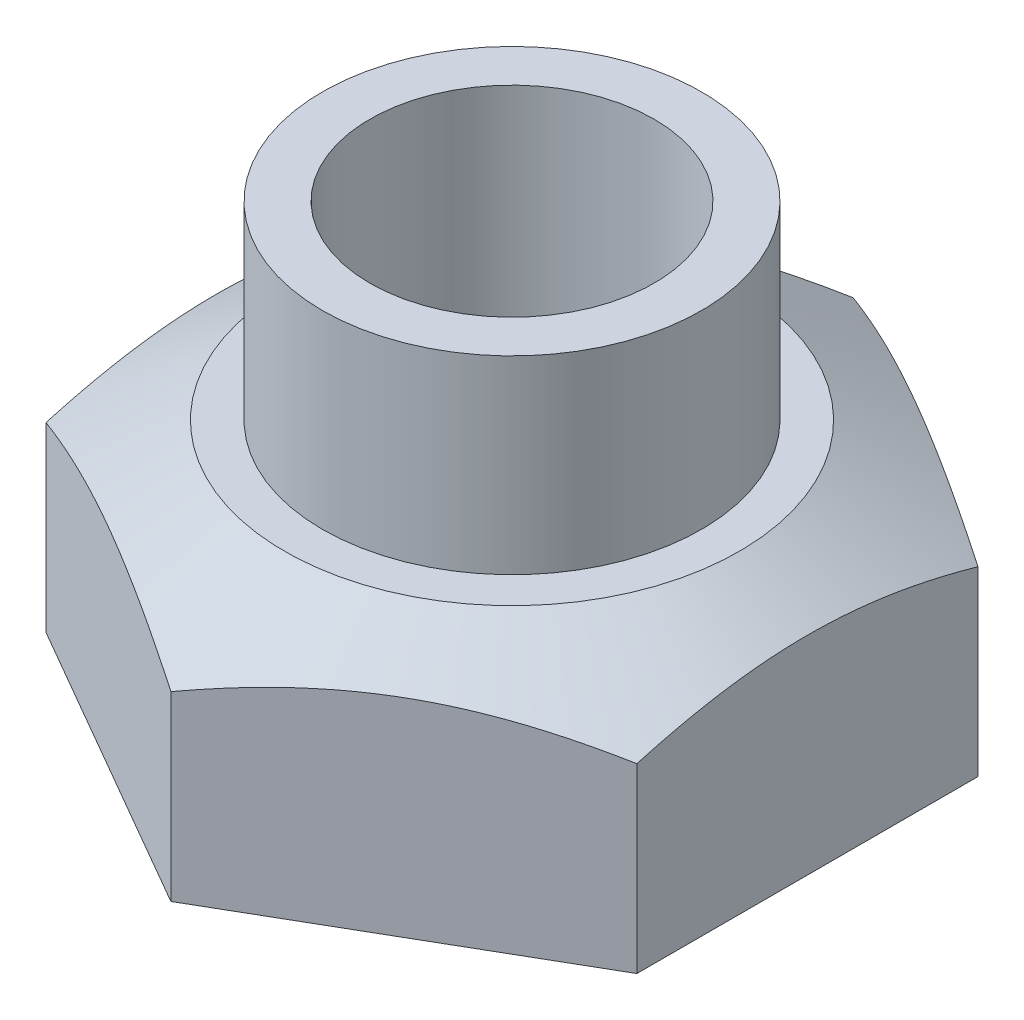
ISO-10303-21;
HEADER;
FILE_DESCRIPTION(('STEP AP214'),'2;1');
FILE_NAME('part.step','',(''),(''),'','','');
FILE_SCHEMA(('AUTOMOTIVE_DESIGN { 1 0 10303 214 1 1 1 1 }'));
ENDSEC;
DATA;
#1=APPLICATION_CONTEXT('core data for automotive mechanical design processes');
#2=APPLICATION_PROTOCOL_DEFINITION('international standard','automotive_design',2000,#1);
#3=PRODUCT_CONTEXT('',#1,'mechanical');
#4=PRODUCT('Part','Part','',(#3));
#5=PRODUCT_RELATED_PRODUCT_CATEGORY('part','',(#4));
#6=PRODUCT_DEFINITION_FORMATION('','',#4);
#7=PRODUCT_DEFINITION_CONTEXT('part definition',#1,'design');
#8=PRODUCT_DEFINITION('design','',#6,#7);
#9=PRODUCT_DEFINITION_SHAPE('','',#8);
#10=(LENGTH_UNIT() NAMED_UNIT(*) SI_UNIT(.MILLI.,.METRE.));
#11=(NAMED_UNIT(*) PLANE_ANGLE_UNIT() SI_UNIT($,.RADIAN.));
#12=(NAMED_UNIT(*) SI_UNIT($,.STERADIAN.) SOLID_ANGLE_UNIT());
#13=UNCERTAINTY_MEASURE_WITH_UNIT(LENGTH_MEASURE(1.E-05),#10,'distance_accuracy_value','');
#14=(GEOMETRIC_REPRESENTATION_CONTEXT(3) GLOBAL_UNCERTAINTY_ASSIGNED_CONTEXT((#13)) GLOBAL_UNIT_ASSIGNED_CONTEXT((#10,
#11,#12)) REPRESENTATION_CONTEXT('',''));
#15=CARTESIAN_POINT('',(0.,0.,0.));
#16=DIRECTION('',(0.,0.,1.));
#17=DIRECTION('',(1.,0.,0.));
#18=AXIS2_PLACEMENT_3D('',#15,#16,#17);
#19=CARTESIAN_POINT('',(0.,65.,0.));
#20=DIRECTION('',(0.,1.,0.));
#21=DIRECTION('',(0.,0.,1.));
#22=AXIS2_PLACEMENT_3D('',#19,#20,#21);
#23=PLANE('',#22);
#24=CARTESIAN_POINT('',(0.,65.,0.));
#25=DIRECTION('',(0.,-1.,0.));
#26=DIRECTION('',(0.,0.,-1.));
#27=AXIS2_PLACEMENT_3D('',#24,#25,#26);
#28=CIRCLE('',#27,60.);
#29=CARTESIAN_POINT('',(0.,65.,-60.));
#30=VERTEX_POINT('',#29);
#31=EDGE_CURVE('E109',#30,#30,#28,.T.);
#32=ORIENTED_EDGE('',*,*,#31,.F.);
#33=EDGE_LOOP('',(#32));
#34=FACE_BOUND('',#33,.T.);
#35=CARTESIAN_POINT('',(0.,65.,0.));
#36=DIRECTION('',(0.,1.,0.));
#37=DIRECTION('',(0.,0.,1.));
#38=AXIS2_PLACEMENT_3D('',#35,#36,#37);
#39=CIRCLE('',#38,50.);
#40=CARTESIAN_POINT('',(0.,65.,50.));
#41=VERTEX_POINT('',#40);
#42=EDGE_CURVE('E225',#41,#41,#39,.T.);
#43=ORIENTED_EDGE('',*,*,#42,.F.);
#44=EDGE_LOOP('',(#43));
#45=FACE_BOUND('',#44,.T.);
#46=ADVANCED_FACE('F51',(#34,#45),#23,.T.);
#47=CARTESIAN_POINT('',(-77.9422863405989,65.,45.0000000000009));
#48=DIRECTION('',(0.499999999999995,0.,-0.866025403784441));
#49=DIRECTION('',(-0.866025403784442,0.,-0.499999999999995));
#50=AXIS2_PLACEMENT_3D('',#47,#48,#49);
#51=PLANE('',#50);
#52=DIRECTION('',(0.,-1.,0.));
#53=VECTOR('',#52,1.);
#54=CARTESIAN_POINT('',(0.,65.,90.));
#55=LINE('',#54,#53);
#56=CARTESIAN_POINT('',(0.,47.9534695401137,90.));
#57=VERTEX_POINT('',#56);
#58=CARTESIAN_POINT('',(0.,0.,90.));
#59=VERTEX_POINT('',#58);
#60=EDGE_CURVE('E13',#57,#59,#55,.T.);
#61=ORIENTED_EDGE('',*,*,#60,.F.);
#62=CARTESIAN_POINT('',(0.000200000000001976,47.9534039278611,90.0001154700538));
#63=CARTESIAN_POINT('',(-1.71052898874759,48.5145828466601,89.0124256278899));
#64=CARTESIAN_POINT('',(-3.42772717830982,49.0502642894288,88.0210007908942));
#65=CARTESIAN_POINT('',(-6.87545842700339,50.0636152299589,86.0304522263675));
#66=CARTESIAN_POINT('',(-8.60599550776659,50.541266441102,85.0313261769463));
#67=CARTESIAN_POINT('',(-12.0836470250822,51.4321827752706,83.0235031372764));
#68=CARTESIAN_POINT('',(-13.8307900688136,51.8453000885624,82.0147896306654));
#69=CARTESIAN_POINT('',(-17.3367568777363,52.5983903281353,79.990618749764));
#70=CARTESIAN_POINT('',(-19.0955795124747,52.9383702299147,78.9751620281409));
#71=CARTESIAN_POINT('',(-22.5813781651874,53.5310753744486,76.9626352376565));
#72=CARTESIAN_POINT('',(-24.3081117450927,53.7856903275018,75.9657051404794));
#73=CARTESIAN_POINT('',(-27.7692544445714,54.2130038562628,73.9674134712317));
#74=CARTESIAN_POINT('',(-29.5036637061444,54.3857009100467,72.9660518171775));
#75=CARTESIAN_POINT('',(-32.9753470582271,54.6448807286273,70.9616744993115));
#76=CARTESIAN_POINT('',(-34.7126156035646,54.7314618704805,69.9586620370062));
#77=CARTESIAN_POINT('',(-38.1887469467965,54.8165604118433,67.9517166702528));
#78=CARTESIAN_POINT('',(-39.9276096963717,54.8150803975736,66.9477837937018));
#79=CARTESIAN_POINT('',(-43.1842852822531,54.7298668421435,65.0675412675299));
#80=CARTESIAN_POINT('',(-44.7023107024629,54.6565334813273,64.1911088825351));
#81=CARTESIAN_POINT('',(-47.7348789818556,54.4441159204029,62.4402547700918));
#82=CARTESIAN_POINT('',(-49.2494218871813,54.3050325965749,61.5658330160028));
#83=CARTESIAN_POINT('',(-52.2744480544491,53.9635274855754,59.8193333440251));
#84=CARTESIAN_POINT('',(-53.7849266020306,53.7610503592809,58.9472581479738));
#85=CARTESIAN_POINT('',(-56.7989248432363,53.2962955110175,57.2071254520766));
#86=CARTESIAN_POINT('',(-58.3024445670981,53.0340180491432,56.3390679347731));
#87=CARTESIAN_POINT('',(-61.3335112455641,52.4475764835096,54.5890807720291));
#88=CARTESIAN_POINT('',(-62.8608824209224,52.1222063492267,53.7072526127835));
#89=CARTESIAN_POINT('',(-65.9065454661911,51.4181218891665,51.9488382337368));
#90=CARTESIAN_POINT('',(-67.4248361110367,51.0394005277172,51.072252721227));
#91=CARTESIAN_POINT('',(-70.4488837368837,50.2343085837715,49.3263180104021));
#92=CARTESIAN_POINT('',(-71.9546587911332,49.8080280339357,48.4569583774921));
#93=CARTESIAN_POINT('',(-74.9560762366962,48.9120862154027,46.7240892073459));
#94=CARTESIAN_POINT('',(-76.4517212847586,48.4424368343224,45.8605781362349));
#95=CARTESIAN_POINT('',(-77.9424863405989,47.9534039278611,44.999884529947));
#96=B_SPLINE_CURVE_WITH_KNOTS('',3,(#62,#63,#64,#65,#66,#67,#68,#69,#70,#71,#72,#73,#74,#75,#76,
#77,#78,#79,#80,#81,#82,#83,#84,#85,#86,#87,#88,#89,#90,#91,#92,#93,#94,#95),.UNSPECIFIED.,.F.,
.F.,(4,2,2,2,2,2,2,2,2,2,2,2,2,2,2,2,4),(0.,6.16078805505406,12.323512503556,18.5001515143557,
24.6762011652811,30.7047716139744,36.7334540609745,42.7552415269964,48.776852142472,
54.0388114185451,59.30070056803,64.5671959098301,69.8336683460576,75.2130272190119,
80.5930961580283,85.9631477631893,91.3317317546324),.UNSPECIFIED.);
#97=CARTESIAN_POINT('',(-77.9422863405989,47.9534695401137,45.0000000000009));
#98=VERTEX_POINT('',#97);
#99=EDGE_CURVE('E105',#57,#98,#96,.T.);
#100=ORIENTED_EDGE('',*,*,#99,.T.);
#101=DIRECTION('',(0.,-1.,0.));
#102=VECTOR('',#101,1.);
#103=CARTESIAN_POINT('',(-77.9422863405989,65.,45.0000000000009));
#104=LINE('',#103,#102);
#105=CARTESIAN_POINT('',(-77.9422863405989,0.,45.0000000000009));
#106=VERTEX_POINT('',#105);
#107=EDGE_CURVE('E75',#98,#106,#104,.T.);
#108=ORIENTED_EDGE('',*,*,#107,.T.);
#109=DIRECTION('',(0.866025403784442,0.,0.499999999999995));
#110=VECTOR('',#109,1.);
#111=CARTESIAN_POINT('',(-77.9422863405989,0.,45.0000000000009));
#112=LINE('',#111,#110);
#113=EDGE_CURVE('E112',#106,#59,#112,.T.);
#114=ORIENTED_EDGE('',*,*,#113,.T.);
#115=EDGE_LOOP('',(#61,#100,#108,#114));
#116=FACE_BOUND('',#115,.T.);
#117=ADVANCED_FACE('F53',(#116),#51,.F.);
#118=CARTESIAN_POINT('',(0.,65.,90.));
#119=DIRECTION('',(-0.500000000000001,0.,-0.866025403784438));
#120=DIRECTION('',(-0.866025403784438,0.,0.500000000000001));
#121=AXIS2_PLACEMENT_3D('',#118,#119,#120);
#122=PLANE('',#121);
#123=DIRECTION('',(0.,-1.,0.));
#124=VECTOR('',#123,1.);
#125=CARTESIAN_POINT('',(77.9422863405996,65.,44.9999999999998));
#126=LINE('',#125,#124);
#127=CARTESIAN_POINT('',(77.9422863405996,47.9534695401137,44.9999999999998));
#128=VERTEX_POINT('',#127);
#129=CARTESIAN_POINT('',(77.9422863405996,0.,44.9999999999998));
#130=VERTEX_POINT('',#129);
#131=EDGE_CURVE('E60',#128,#130,#126,.T.);
#132=ORIENTED_EDGE('',*,*,#131,.F.);
#133=CARTESIAN_POINT('',(77.9424863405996,47.9534039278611,44.999884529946));
#134=CARTESIAN_POINT('',(76.231757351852,48.5145828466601,45.9875743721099));
#135=CARTESIAN_POINT('',(74.5145591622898,49.0502642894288,46.9789992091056));
#136=CARTESIAN_POINT('',(71.0668279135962,50.063615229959,48.9695477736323));
#137=CARTESIAN_POINT('',(69.336290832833,50.5412664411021,49.9686738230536));
#138=CARTESIAN_POINT('',(65.8586393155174,51.4321827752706,51.9764968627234));
#139=CARTESIAN_POINT('',(64.1114962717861,51.8453000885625,52.9852103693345));
#140=CARTESIAN_POINT('',(60.6055294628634,52.5983903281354,55.0093812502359));
#141=CARTESIAN_POINT('',(58.8467068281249,52.9383702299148,56.024837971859));
#142=CARTESIAN_POINT('',(55.3609081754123,53.5310753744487,58.0373647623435));
#143=CARTESIAN_POINT('',(53.634174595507,53.7856903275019,59.0342948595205));
#144=CARTESIAN_POINT('',(50.1730318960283,54.2130038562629,61.0325865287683));
#145=CARTESIAN_POINT('',(48.4386226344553,54.3857009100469,62.0339481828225));
#146=CARTESIAN_POINT('',(44.9669392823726,54.6448807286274,64.0383255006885));
#147=CARTESIAN_POINT('',(43.2296707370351,54.7314618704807,65.0413379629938));
#148=CARTESIAN_POINT('',(39.7535393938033,54.8165604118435,67.0482833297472));
#149=CARTESIAN_POINT('',(38.014676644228,54.8150803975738,68.0522162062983));
#150=CARTESIAN_POINT('',(34.7580010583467,54.7298668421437,69.9324587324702));
#151=CARTESIAN_POINT('',(33.2399756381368,54.6565334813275,70.808891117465));
#152=CARTESIAN_POINT('',(30.207407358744,54.4441159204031,72.5597452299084));
#153=CARTESIAN_POINT('',(28.6928644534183,54.3050325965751,73.4341669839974));
#154=CARTESIAN_POINT('',(25.6678382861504,53.9635274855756,75.1806666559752));
#155=CARTESIAN_POINT('',(24.1573597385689,53.7610503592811,76.0527418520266));
#156=CARTESIAN_POINT('',(21.1433614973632,53.2962955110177,77.7928745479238));
#157=CARTESIAN_POINT('',(19.6398417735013,53.0340180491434,78.6609320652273));
#158=CARTESIAN_POINT('',(16.6087750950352,52.4475764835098,80.4109192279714));
#159=CARTESIAN_POINT('',(15.0814039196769,52.1222063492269,81.292747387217));
#160=CARTESIAN_POINT('',(12.0357408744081,51.4181218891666,83.0511617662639));
#161=CARTESIAN_POINT('',(10.5174502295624,51.0394005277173,83.9277472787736));
#162=CARTESIAN_POINT('',(7.49340260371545,50.2343085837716,85.6736819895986));
#163=CARTESIAN_POINT('',(5.98762754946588,49.8080280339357,86.5430416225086));
#164=CARTESIAN_POINT('',(2.98621010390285,48.9120862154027,88.2759107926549));
#165=CARTESIAN_POINT('',(1.49056505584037,48.4424368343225,89.1394218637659));
#166=CARTESIAN_POINT('',(-0.000199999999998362,47.9534039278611,90.0001154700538));
#167=B_SPLINE_CURVE_WITH_KNOTS('',3,(#133,#134,#135,#136,#137,#138,#139,#140,#141,#142,#143,
#144,#145,#146,#147,#148,#149,#150,#151,#152,#153,#154,#155,#156,#157,#158,#159,#160,#161,#162,
#163,#164,#165,#166),.UNSPECIFIED.,.F.,.F.,(4,2,2,2,2,2,2,2,2,2,2,2,2,2,2,2,4),(0.,
6.16078805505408,12.323512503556,18.5001515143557,24.6762011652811,30.7047716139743,
36.7334540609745,42.7552415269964,48.776852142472,54.0388114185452,59.3007005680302,
64.5671959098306,69.8336683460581,75.2130272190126,80.5930961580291,85.9631477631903,
91.3317317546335),.UNSPECIFIED.);
#168=EDGE_CURVE('E113',#128,#57,#167,.T.);
#169=ORIENTED_EDGE('',*,*,#168,.T.);
#170=ORIENTED_EDGE('',*,*,#60,.T.);
#171=DIRECTION('',(0.866025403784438,0.,-0.500000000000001));
#172=VECTOR('',#171,1.);
#173=CARTESIAN_POINT('',(0.,0.,90.));
#174=LINE('',#173,#172);
#175=EDGE_CURVE('E142',#59,#130,#174,.T.);
#176=ORIENTED_EDGE('',*,*,#175,.T.);
#177=EDGE_LOOP('',(#132,#169,#170,#176));
#178=FACE_BOUND('',#177,.T.);
#179=ADVANCED_FACE('F143',(#178),#122,.F.);
#180=CARTESIAN_POINT('',(77.9422863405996,65.,44.9999999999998));
#181=DIRECTION('',(-1.,0.,0.));
#182=DIRECTION('',(0.,0.,1.));
#183=AXIS2_PLACEMENT_3D('',#180,#181,#182);
#184=PLANE('',#183);
#185=DIRECTION('',(0.,-1.,0.));
#186=VECTOR('',#185,1.);
#187=CARTESIAN_POINT('',(77.9422863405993,65.,-45.0000000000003));
#188=LINE('',#187,#186);
#189=CARTESIAN_POINT('',(77.9422863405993,47.9534695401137,-45.0000000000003));
#190=VERTEX_POINT('',#189);
#191=CARTESIAN_POINT('',(77.9422863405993,0.,-45.0000000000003));
#192=VERTEX_POINT('',#191);
#193=EDGE_CURVE('E128',#190,#192,#188,.T.);
#194=ORIENTED_EDGE('',*,*,#193,.F.);
#195=CARTESIAN_POINT('',(77.9422863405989,8.11041611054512,-139.868529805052));
#196=CARTESIAN_POINT('',(77.942286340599,8.94745712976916,-138.182119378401));
#197=CARTESIAN_POINT('',(77.942286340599,9.78164370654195,-136.494289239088));
#198=CARTESIAN_POINT('',(77.942286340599,11.4437121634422,-133.115518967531));
#199=CARTESIAN_POINT('',(77.942286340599,12.2715940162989,-131.424578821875));
#200=CARTESIAN_POINT('',(77.942286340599,13.9205021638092,-128.039225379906));
#201=CARTESIAN_POINT('',(77.942286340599,14.7415280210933,-126.344811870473));
#202=CARTESIAN_POINT('',(77.942286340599,16.3759744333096,-122.952321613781));
#203=CARTESIAN_POINT('',(77.942286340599,17.1893949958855,-121.254244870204));
#204=CARTESIAN_POINT('',(77.942286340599,18.8094714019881,-117.850693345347));
#205=CARTESIAN_POINT('',(77.942286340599,19.6161104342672,-116.145210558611));
#206=CARTESIAN_POINT('',(77.942286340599,21.2200766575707,-112.729872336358));
#207=CARTESIAN_POINT('',(77.942286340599,22.0174038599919,-111.020016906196));
#208=CARTESIAN_POINT('',(77.9422863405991,23.6017228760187,-107.595553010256));
#209=CARTESIAN_POINT('',(77.9422863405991,24.388714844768,-105.880944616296));
#210=CARTESIAN_POINT('',(77.9422863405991,25.951218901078,-102.446509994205));
#211=CARTESIAN_POINT('',(77.9422863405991,26.7267310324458,-100.726683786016));
#212=CARTESIAN_POINT('',(77.9422863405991,28.3008293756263,-97.2009824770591));
#213=CARTESIAN_POINT('',(77.9422863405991,29.0988051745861,-95.3948346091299));
#214=CARTESIAN_POINT('',(77.9422863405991,30.6790145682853,-91.7756576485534));
#215=CARTESIAN_POINT('',(77.9422863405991,31.4612481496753,-89.9626285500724));
#216=CARTESIAN_POINT('',(77.9422863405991,33.0080176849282,-86.3289162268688));
#217=CARTESIAN_POINT('',(77.9422863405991,33.7725527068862,-84.5082326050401));
#218=CARTESIAN_POINT('',(77.9422863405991,35.2815787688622,-80.8585708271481));
#219=CARTESIAN_POINT('',(77.9422863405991,36.0260698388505,-79.0295926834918));
#220=CARTESIAN_POINT('',(77.9422863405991,37.4919037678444,-75.3636650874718));
#221=CARTESIAN_POINT('',(77.9422863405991,38.2132604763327,-73.5267211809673));
#222=CARTESIAN_POINT('',(77.9422863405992,39.6302451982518,-69.8429060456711));
#223=CARTESIAN_POINT('',(77.9422863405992,40.3258730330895,-67.9960347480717));
#224=CARTESIAN_POINT('',(77.9422863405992,41.687814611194,-64.2916794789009));
#225=CARTESIAN_POINT('',(77.9422863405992,42.3541309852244,-62.4341964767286));
#226=CARTESIAN_POINT('',(77.9422863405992,43.6534621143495,-58.7076504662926));
#227=CARTESIAN_POINT('',(77.9422863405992,44.2864776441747,-56.8385877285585));
#228=CARTESIAN_POINT('',(77.9422863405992,45.6475324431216,-52.6822550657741));
#229=CARTESIAN_POINT('',(77.9422863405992,46.3664980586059,-50.3919968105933));
#230=CARTESIAN_POINT('',(77.9422863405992,47.7390463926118,-45.7919005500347));
#231=CARTESIAN_POINT('',(77.9422863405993,48.3926295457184,-43.4820626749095));
#232=CARTESIAN_POINT('',(77.9422863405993,49.623833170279,-38.8421320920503));
#233=CARTESIAN_POINT('',(77.9422863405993,50.2014546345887,-36.5120396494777));
#234=CARTESIAN_POINT('',(77.9422863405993,51.2692752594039,-31.8318051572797));
#235=CARTESIAN_POINT('',(77.9422863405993,51.7594749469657,-29.4816632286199));
#236=CARTESIAN_POINT('',(77.9422863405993,52.6330571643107,-24.8035525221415));
#237=CARTESIAN_POINT('',(77.9422863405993,53.0181455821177,-22.4759065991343));
#238=CARTESIAN_POINT('',(77.9422863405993,53.5161109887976,-18.9732135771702));
#239=CARTESIAN_POINT('',(77.9422863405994,53.6688254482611,-17.8037383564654));
#240=CARTESIAN_POINT('',(77.9422863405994,53.9465753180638,-15.46151862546));
#241=CARTESIAN_POINT('',(77.9422863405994,54.0716116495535,-14.2887742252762));
#242=CARTESIAN_POINT('',(77.9422863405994,54.2929695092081,-11.9409959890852));
#243=CARTESIAN_POINT('',(77.9422863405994,54.3893011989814,-10.7659631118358));
#244=CARTESIAN_POINT('',(77.9422863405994,54.5525125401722,-8.41384765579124));
#245=CARTESIAN_POINT('',(77.9422863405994,54.6193922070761,-7.23676507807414));
#246=CARTESIAN_POINT('',(77.9422863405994,54.723124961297,-4.88127736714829));
#247=CARTESIAN_POINT('',(77.9422863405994,54.7599781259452,-3.70287223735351));
#248=CARTESIAN_POINT('',(77.9422863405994,54.8033354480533,-1.34550199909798));
#249=CARTESIAN_POINT('',(77.9422863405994,54.809839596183,-0.166536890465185));
#250=CARTESIAN_POINT('',(77.9422863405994,54.7923887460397,2.19826285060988));
#251=CARTESIAN_POINT('',(77.9422863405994,54.7682502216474,3.38409612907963));
#252=CARTESIAN_POINT('',(77.9422863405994,54.6894144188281,5.75474410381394));
#253=CARTESIAN_POINT('',(77.9422863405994,54.6347171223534,6.93955879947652));
#254=CARTESIAN_POINT('',(77.9422863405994,54.495243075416,9.3074194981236));
#255=CARTESIAN_POINT('',(77.9422863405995,54.4104661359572,10.4904654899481));
#256=CARTESIAN_POINT('',(77.9422863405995,54.2115563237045,12.854079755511));
#257=CARTESIAN_POINT('',(77.9422863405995,54.0974234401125,14.0346480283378));
#258=CARTESIAN_POINT('',(77.9422863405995,53.8406833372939,16.3931545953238));
#259=CARTESIAN_POINT('',(77.9422863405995,53.6980648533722,17.5710916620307));
#260=CARTESIAN_POINT('',(77.9422863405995,53.38549624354,19.9233470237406));
#261=CARTESIAN_POINT('',(77.9422863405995,53.2155452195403,21.0976651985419));
#262=CARTESIAN_POINT('',(77.9422863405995,52.6665426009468,24.6144312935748));
#263=CARTESIAN_POINT('',(77.9422863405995,52.2483237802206,26.9508503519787));
#264=CARTESIAN_POINT('',(77.9422863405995,51.3102284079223,31.6458934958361));
#265=CARTESIAN_POINT('',(77.9422863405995,50.7886861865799,34.0041804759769));
#266=CARTESIAN_POINT('',(77.9422863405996,49.6607919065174,38.7002815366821));
#267=CARTESIAN_POINT('',(77.9422863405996,49.0544394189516,41.0380955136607));
#268=CARTESIAN_POINT('',(77.9422863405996,47.7683914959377,45.6932464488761));
#269=CARTESIAN_POINT('',(77.9422863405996,47.0886986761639,48.0105841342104));
#270=CARTESIAN_POINT('',(77.9422863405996,45.6663519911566,52.6257878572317));
#271=CARTESIAN_POINT('',(77.9422863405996,44.9236977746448,54.9236537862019));
#272=CARTESIAN_POINT('',(77.9422863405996,43.5416583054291,59.0339984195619));
#273=CARTESIAN_POINT('',(77.9422863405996,42.9121370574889,60.8498124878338));
#274=CARTESIAN_POINT('',(77.9422863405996,41.622999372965,64.4707522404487));
#275=CARTESIAN_POINT('',(77.9422863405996,40.9633823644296,66.2758777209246));
#276=CARTESIAN_POINT('',(77.9422863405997,39.6175713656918,69.8763235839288));
#277=CARTESIAN_POINT('',(77.9422863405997,38.9313754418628,71.6716432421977));
#278=CARTESIAN_POINT('',(77.9422863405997,37.5355578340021,75.253127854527));
#279=CARTESIAN_POINT('',(77.9422863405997,36.8259362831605,77.0392928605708));
#280=CARTESIAN_POINT('',(77.9422863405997,35.3856007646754,80.6041513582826));
#281=CARTESIAN_POINT('',(77.9422863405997,34.6548761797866,82.3828405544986));
#282=CARTESIAN_POINT('',(77.9422863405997,33.1750382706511,85.9325469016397));
#283=CARTESIAN_POINT('',(77.9422863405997,32.4259249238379,87.7035640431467));
#284=CARTESIAN_POINT('',(77.9422863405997,30.9113930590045,91.2385145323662));
#285=CARTESIAN_POINT('',(77.9422863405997,30.1459752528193,93.0024481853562));
#286=CARTESIAN_POINT('',(77.9422863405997,28.60058662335,96.5239223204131));
#287=CARTESIAN_POINT('',(77.9422863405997,27.8206158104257,98.2814628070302));
#288=CARTESIAN_POINT('',(77.9422863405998,26.2818926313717,101.714368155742));
#289=CARTESIAN_POINT('',(77.9422863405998,25.5236936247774,103.389981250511));
#290=CARTESIAN_POINT('',(77.9422863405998,23.9965871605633,106.736325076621));
#291=CARTESIAN_POINT('',(77.9422863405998,23.227679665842,108.407055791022));
#292=CARTESIAN_POINT('',(77.9422863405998,21.6801953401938,111.74405695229));
#293=CARTESIAN_POINT('',(77.9422863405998,20.9016183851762,113.410327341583));
#294=CARTESIAN_POINT('',(77.9422863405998,19.3357258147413,116.738757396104));
#295=CARTESIAN_POINT('',(77.9422863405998,18.5484101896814,118.400917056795));
#296=CARTESIAN_POINT('',(77.9422863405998,16.9672125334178,121.718612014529));
#297=CARTESIAN_POINT('',(77.9422863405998,16.173344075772,123.374153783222));
#298=CARTESIAN_POINT('',(77.9422863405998,14.5784269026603,126.681775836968));
#299=CARTESIAN_POINT('',(77.9422863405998,13.7773781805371,128.33385611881));
#300=CARTESIAN_POINT('',(77.9422863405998,12.1687869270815,131.634735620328));
#301=CARTESIAN_POINT('',(77.9422863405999,11.3612447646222,133.283535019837));
#302=CARTESIAN_POINT('',(77.9422863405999,9.74017891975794,136.578183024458));
#303=CARTESIAN_POINT('',(77.9422863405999,8.92665526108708,138.224031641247));
#304=CARTESIAN_POINT('',(77.9422863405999,8.11041611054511,139.868529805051));
#305=B_SPLINE_CURVE_WITH_KNOTS('',3,(#195,#196,#197,#198,#199,#200,#201,#202,#203,#204,#205,
#206,#207,#208,#209,#210,#211,#212,#213,#214,#215,#216,#217,#218,#219,#220,#221,#222,#223,#224,
#225,#226,#227,#228,#229,#230,#231,#232,#233,#234,#235,#236,#237,#238,#239,#240,#241,#242,#243,
#244,#245,#246,#247,#248,#249,#250,#251,#252,#253,#254,#255,#256,#257,#258,#259,#260,#261,#262,
#263,#264,#265,#266,#267,#268,#269,#270,#271,#272,#273,#274,#275,#276,#277,#278,#279,#280,#281,
#282,#283,#284,#285,#286,#287,#288,#289,#290,#291,#292,#293,#294,#295,#296,#297,#298,#299,#300,
#301,#302,#303,#304),.UNSPECIFIED.,.F.,.F.,(4,2,2,2,2,2,2,2,2,2,2,2,2,2,2,2,2,2,2,2,2,2,2,2,2,2,
2,2,2,2,2,2,2,2,2,2,2,2,2,2,2,2,2,2,2,2,2,2,2,2,2,2,2,2,4),(0.,5.64814779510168,
11.2963200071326,16.9448498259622,22.5933739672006,28.2532110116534,33.9130411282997,
39.5727861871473,45.2325096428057,51.1561594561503,57.079814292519,63.0037803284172,
68.9277375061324,74.8480794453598,80.7684624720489,86.6883130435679,92.6080258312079,
99.8085438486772,107.009014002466,114.209390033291,121.409722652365,128.485115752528,
132.023054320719,135.560875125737,139.097442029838,142.634007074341,146.170563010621,
149.707120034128,153.264958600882,156.822799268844,160.380662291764,163.93852662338,
167.497800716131,171.057191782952,178.175492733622,185.41957059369,192.663685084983,
199.907541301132,207.15143793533,212.916688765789,218.682049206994,224.447829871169,
230.213577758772,235.982278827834,241.75098697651,247.519443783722,253.287896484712,
258.805364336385,264.322851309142,269.840409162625,275.357973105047,280.866076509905,
286.374185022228,291.881982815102,297.389758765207),.UNSPECIFIED.);
#306=EDGE_CURVE('E139',#190,#128,#305,.T.);
#307=ORIENTED_EDGE('',*,*,#306,.T.);
#308=ORIENTED_EDGE('',*,*,#131,.T.);
#309=DIRECTION('',(0.,0.,-1.));
#310=VECTOR('',#309,1.);
#311=CARTESIAN_POINT('',(77.9422863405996,0.,44.9999999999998));
#312=LINE('',#311,#310);
#313=EDGE_CURVE('E137',#130,#192,#312,.T.);
#314=ORIENTED_EDGE('',*,*,#313,.T.);
#315=EDGE_LOOP('',(#194,#307,#308,#314));
#316=FACE_BOUND('',#315,.T.);
#317=ADVANCED_FACE('F135',(#316),#184,.F.);
#318=CARTESIAN_POINT('',(77.9422863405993,65.,-45.0000000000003));
#319=DIRECTION('',(-0.499999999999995,0.,0.866025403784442));
#320=DIRECTION('',(0.866025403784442,0.,0.499999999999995));
#321=AXIS2_PLACEMENT_3D('',#318,#319,#320);
#322=PLANE('',#321);
#323=DIRECTION('',(0.,-1.,0.));
#324=VECTOR('',#323,1.);
#325=CARTESIAN_POINT('',(-6.28466640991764E-13,65.,-90.));
#326=LINE('',#325,#324);
#327=CARTESIAN_POINT('',(-6.28174321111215E-13,47.9534695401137,-90.));
#328=VERTEX_POINT('',#327);
#329=CARTESIAN_POINT('',(-6.28466640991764E-13,0.,-90.));
#330=VERTEX_POINT('',#329);
#331=EDGE_CURVE('E121',#328,#330,#326,.T.);
#332=ORIENTED_EDGE('',*,*,#331,.F.);
#333=CARTESIAN_POINT('',(-0.000200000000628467,47.9534039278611,-90.0001154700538));
#334=CARTESIAN_POINT('',(1.71052898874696,48.5145828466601,-89.0124256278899));
#335=CARTESIAN_POINT('',(3.42772717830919,49.0502642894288,-88.0210007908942));
#336=CARTESIAN_POINT('',(6.87545842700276,50.063615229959,-86.0304522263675));
#337=CARTESIAN_POINT('',(8.60599550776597,50.5412664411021,-85.0313261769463));
#338=CARTESIAN_POINT('',(12.0836470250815,51.4321827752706,-83.0235031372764));
#339=CARTESIAN_POINT('',(13.8307900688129,51.8453000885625,-82.0147896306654));
#340=CARTESIAN_POINT('',(17.3367568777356,52.5983903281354,-79.990618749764));
#341=CARTESIAN_POINT('',(19.0955795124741,52.9383702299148,-78.9751620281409));
#342=CARTESIAN_POINT('',(22.5813781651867,53.5310753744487,-76.9626352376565));
#343=CARTESIAN_POINT('',(24.308111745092,53.7856903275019,-75.9657051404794));
#344=CARTESIAN_POINT('',(27.7692544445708,54.2130038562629,-73.9674134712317));
#345=CARTESIAN_POINT('',(29.5036637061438,54.3857009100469,-72.9660518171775));
#346=CARTESIAN_POINT('',(32.9753470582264,54.6448807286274,-70.9616744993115));
#347=CARTESIAN_POINT('',(34.7126156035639,54.7314618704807,-69.9586620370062));
#348=CARTESIAN_POINT('',(38.1887469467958,54.8165604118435,-67.9517166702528));
#349=CARTESIAN_POINT('',(39.9276096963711,54.8150803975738,-66.9477837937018));
#350=CARTESIAN_POINT('',(43.1842852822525,54.7298668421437,-65.0675412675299));
#351=CARTESIAN_POINT('',(44.7023107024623,54.6565334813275,-64.1911088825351));
#352=CARTESIAN_POINT('',(47.7348789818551,54.4441159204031,-62.4402547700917));
#353=CARTESIAN_POINT('',(49.2494218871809,54.3050325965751,-61.5658330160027));
#354=CARTESIAN_POINT('',(52.2744480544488,53.9635274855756,-59.8193333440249));
#355=CARTESIAN_POINT('',(53.7849266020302,53.7610503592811,-58.9472581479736));
#356=CARTESIAN_POINT('',(56.798924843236,53.2962955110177,-57.2071254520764));
#357=CARTESIAN_POINT('',(58.3024445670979,53.0340180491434,-56.3390679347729));
#358=CARTESIAN_POINT('',(61.333511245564,52.4475764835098,-54.5890807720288));
#359=CARTESIAN_POINT('',(62.8608824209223,52.1222063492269,-53.7072526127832));
#360=CARTESIAN_POINT('',(65.9065454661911,51.4181218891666,-51.9488382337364));
#361=CARTESIAN_POINT('',(67.4248361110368,51.0394005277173,-51.0722527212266));
#362=CARTESIAN_POINT('',(70.4488837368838,50.2343085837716,-49.3263180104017));
#363=CARTESIAN_POINT('',(71.9546587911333,49.8080280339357,-48.4569583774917));
#364=CARTESIAN_POINT('',(74.9560762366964,48.9120862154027,-46.7240892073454));
#365=CARTESIAN_POINT('',(76.4517212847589,48.4424368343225,-45.8605781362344));
#366=CARTESIAN_POINT('',(77.9424863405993,47.9534039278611,-44.9998845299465));
#367=B_SPLINE_CURVE_WITH_KNOTS('',3,(#333,#334,#335,#336,#337,#338,#339,#340,#341,#342,#343,
#344,#345,#346,#347,#348,#349,#350,#351,#352,#353,#354,#355,#356,#357,#358,#359,#360,#361,#362,
#363,#364,#365,#366),.UNSPECIFIED.,.F.,.F.,(4,2,2,2,2,2,2,2,2,2,2,2,2,2,2,2,4),(0.,
6.16078805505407,12.323512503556,18.5001515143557,24.6762011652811,30.7047716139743,
36.7334540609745,42.7552415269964,48.7768521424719,54.0388114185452,59.3007005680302,
64.5671959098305,69.8336683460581,75.2130272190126,80.5930961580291,85.9631477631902,
91.3317317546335),.UNSPECIFIED.);
#368=EDGE_CURVE('E194',#328,#190,#367,.T.);
#369=ORIENTED_EDGE('',*,*,#368,.T.);
#370=ORIENTED_EDGE('',*,*,#193,.T.);
#371=DIRECTION('',(-0.866025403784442,0.,-0.499999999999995));
#372=VECTOR('',#371,1.);
#373=CARTESIAN_POINT('',(77.9422863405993,0.,-45.0000000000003));
#374=LINE('',#373,#372);
#375=EDGE_CURVE('E149',#192,#330,#374,.T.);
#376=ORIENTED_EDGE('',*,*,#375,.T.);
#377=EDGE_LOOP('',(#332,#369,#370,#376));
#378=FACE_BOUND('',#377,.T.);
#379=ADVANCED_FACE('F207',(#378),#322,.F.);
#380=CARTESIAN_POINT('',(-6.28466640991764E-13,65.,-90.));
#381=DIRECTION('',(0.500000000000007,0.,0.866025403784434));
#382=DIRECTION('',(0.866025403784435,0.,-0.500000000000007));
#383=AXIS2_PLACEMENT_3D('',#380,#381,#382);
#384=PLANE('',#383);
#385=DIRECTION('',(0.,-1.,0.));
#386=VECTOR('',#385,1.);
#387=CARTESIAN_POINT('',(-77.9422863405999,65.,-44.9999999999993));
#388=LINE('',#387,#386);
#389=CARTESIAN_POINT('',(-77.9422863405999,47.9534695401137,-44.9999999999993));
#390=VERTEX_POINT('',#389);
#391=CARTESIAN_POINT('',(-77.9422863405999,0.,-44.9999999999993));
#392=VERTEX_POINT('',#391);
#393=EDGE_CURVE('E119',#390,#392,#388,.T.);
#394=ORIENTED_EDGE('',*,*,#393,.F.);
#395=CARTESIAN_POINT('',(-77.9424863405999,47.9534039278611,-44.9998845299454));
#396=CARTESIAN_POINT('',(-76.2317573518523,48.5145828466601,-45.9875743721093));
#397=CARTESIAN_POINT('',(-74.5145591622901,49.0502642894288,-46.9789992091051));
#398=CARTESIAN_POINT('',(-71.0668279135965,50.063615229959,-48.9695477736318));
#399=CARTESIAN_POINT('',(-69.3362908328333,50.5412664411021,-49.9686738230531));
#400=CARTESIAN_POINT('',(-65.8586393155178,51.4321827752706,-51.9764968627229));
#401=CARTESIAN_POINT('',(-64.1114962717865,51.8453000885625,-52.985210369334));
#402=CARTESIAN_POINT('',(-60.6055294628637,52.5983903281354,-55.0093812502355));
#403=CARTESIAN_POINT('',(-58.8467068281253,52.9383702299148,-56.0248379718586));
#404=CARTESIAN_POINT('',(-55.3609081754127,53.5310753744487,-58.0373647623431));
#405=CARTESIAN_POINT('',(-53.6341745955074,53.7856903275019,-59.0342948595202));
#406=CARTESIAN_POINT('',(-50.1730318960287,54.2130038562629,-61.0325865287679));
#407=CARTESIAN_POINT('',(-48.4386226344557,54.3857009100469,-62.0339481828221));
#408=CARTESIAN_POINT('',(-44.9669392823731,54.6448807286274,-64.0383255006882));
#409=CARTESIAN_POINT('',(-43.2296707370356,54.7314618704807,-65.0413379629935));
#410=CARTESIAN_POINT('',(-39.7535393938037,54.8165604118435,-67.0482833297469));
#411=CARTESIAN_POINT('',(-38.0146766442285,54.8150803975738,-68.052216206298));
#412=CARTESIAN_POINT('',(-34.7580010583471,54.7298668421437,-69.93245873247));
#413=CARTESIAN_POINT('',(-33.2399756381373,54.6565334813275,-70.8088911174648));
#414=CARTESIAN_POINT('',(-30.2074073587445,54.4441159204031,-72.5597452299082));
#415=CARTESIAN_POINT('',(-28.6928644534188,54.3050325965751,-73.4341669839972));
#416=CARTESIAN_POINT('',(-25.6678382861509,53.9635274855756,-75.180666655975));
#417=CARTESIAN_POINT('',(-24.1573597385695,53.7610503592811,-76.0527418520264));
#418=CARTESIAN_POINT('',(-21.1433614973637,53.2962955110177,-77.7928745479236));
#419=CARTESIAN_POINT('',(-19.6398417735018,53.0340180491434,-78.6609320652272));
#420=CARTESIAN_POINT('',(-16.6087750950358,52.4475764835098,-80.4109192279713));
#421=CARTESIAN_POINT('',(-15.0814039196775,52.1222063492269,-81.2927473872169));
#422=CARTESIAN_POINT('',(-12.0357408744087,51.4181218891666,-83.0511617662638));
#423=CARTESIAN_POINT('',(-10.517450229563,51.0394005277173,-83.9277472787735));
#424=CARTESIAN_POINT('',(-7.49340260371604,50.2343085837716,-85.6736819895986));
#425=CARTESIAN_POINT('',(-5.98762754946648,49.8080280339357,-86.5430416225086));
#426=CARTESIAN_POINT('',(-2.98621010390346,48.9120862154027,-88.2759107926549));
#427=CARTESIAN_POINT('',(-1.49056505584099,48.4424368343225,-89.1394218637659));
#428=CARTESIAN_POINT('',(0.000199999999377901,47.9534039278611,-90.0001154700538));
#429=B_SPLINE_CURVE_WITH_KNOTS('',3,(#395,#396,#397,#398,#399,#400,#401,#402,#403,#404,#405,
#406,#407,#408,#409,#410,#411,#412,#413,#414,#415,#416,#417,#418,#419,#420,#421,#422,#423,#424,
#425,#426,#427,#428),.UNSPECIFIED.,.F.,.F.,(4,2,2,2,2,2,2,2,2,2,2,2,2,2,2,2,4),(0.,
6.16078805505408,12.323512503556,18.5001515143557,24.6762011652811,30.7047716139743,
36.7334540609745,42.7552415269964,48.7768521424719,54.0388114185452,59.3007005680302,
64.5671959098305,69.8336683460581,75.2130272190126,80.5930961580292,85.9631477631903,
91.3317317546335),.UNSPECIFIED.);
#430=EDGE_CURVE('E67',#390,#328,#429,.T.);
#431=ORIENTED_EDGE('',*,*,#430,.T.);
#432=ORIENTED_EDGE('',*,*,#331,.T.);
#433=DIRECTION('',(-0.866025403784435,0.,0.500000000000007));
#434=VECTOR('',#433,1.);
#435=CARTESIAN_POINT('',(-6.28466640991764E-13,0.,-90.));
#436=LINE('',#435,#434);
#437=EDGE_CURVE('E123',#330,#392,#436,.T.);
#438=ORIENTED_EDGE('',*,*,#437,.T.);
#439=EDGE_LOOP('',(#394,#431,#432,#438));
#440=FACE_BOUND('',#439,.T.);
#441=ADVANCED_FACE('F155',(#440),#384,.F.);
#442=CARTESIAN_POINT('',(-77.9422863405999,65.,-44.9999999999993));
#443=DIRECTION('',(1.,0.,0.));
#444=DIRECTION('',(0.,0.,-1.));
#445=AXIS2_PLACEMENT_3D('',#442,#443,#444);
#446=PLANE('',#445);
#447=ORIENTED_EDGE('',*,*,#107,.F.);
#448=CARTESIAN_POINT('',(-77.9422863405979,8.11041611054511,139.868529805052));
#449=CARTESIAN_POINT('',(-77.942286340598,8.94745712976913,138.182119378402));
#450=CARTESIAN_POINT('',(-77.942286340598,9.78164370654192,136.494289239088));
#451=CARTESIAN_POINT('',(-77.942286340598,11.4437121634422,133.115518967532));
#452=CARTESIAN_POINT('',(-77.942286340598,12.2715940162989,131.424578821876));
#453=CARTESIAN_POINT('',(-77.9422863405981,13.9205021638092,128.039225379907));
#454=CARTESIAN_POINT('',(-77.9422863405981,14.7415280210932,126.344811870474));
#455=CARTESIAN_POINT('',(-77.9422863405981,16.3759744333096,122.952321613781));
#456=CARTESIAN_POINT('',(-77.9422863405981,17.1893949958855,121.254244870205));
#457=CARTESIAN_POINT('',(-77.9422863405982,18.8094714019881,117.850693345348));
#458=CARTESIAN_POINT('',(-77.9422863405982,19.6161104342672,116.145210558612));
#459=CARTESIAN_POINT('',(-77.9422863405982,21.2200766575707,112.729872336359));
#460=CARTESIAN_POINT('',(-77.9422863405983,22.0174038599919,111.020016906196));
#461=CARTESIAN_POINT('',(-77.9422863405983,23.6017228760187,107.595553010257));
#462=CARTESIAN_POINT('',(-77.9422863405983,24.388714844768,105.880944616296));
#463=CARTESIAN_POINT('',(-77.9422863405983,25.951218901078,102.446509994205));
#464=CARTESIAN_POINT('',(-77.9422863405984,26.7267310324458,100.726683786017));
#465=CARTESIAN_POINT('',(-77.9422863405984,28.3008293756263,97.2009824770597));
#466=CARTESIAN_POINT('',(-77.9422863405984,29.0988051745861,95.3948346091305));
#467=CARTESIAN_POINT('',(-77.9422863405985,30.6790145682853,91.7756576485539));
#468=CARTESIAN_POINT('',(-77.9422863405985,31.4612481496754,89.9626285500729));
#469=CARTESIAN_POINT('',(-77.9422863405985,33.0080176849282,86.3289162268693));
#470=CARTESIAN_POINT('',(-77.9422863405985,33.7725527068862,84.5082326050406));
#471=CARTESIAN_POINT('',(-77.9422863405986,35.2815787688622,80.8585708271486));
#472=CARTESIAN_POINT('',(-77.9422863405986,36.0260698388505,79.0295926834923));
#473=CARTESIAN_POINT('',(-77.9422863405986,37.4919037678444,75.3636650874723));
#474=CARTESIAN_POINT('',(-77.9422863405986,38.2132604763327,73.5267211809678));
#475=CARTESIAN_POINT('',(-77.9422863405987,39.6302451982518,69.8429060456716));
#476=CARTESIAN_POINT('',(-77.9422863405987,40.3258730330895,67.9960347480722));
#477=CARTESIAN_POINT('',(-77.9422863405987,41.687814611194,64.2916794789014));
#478=CARTESIAN_POINT('',(-77.9422863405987,42.3541309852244,62.4341964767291));
#479=CARTESIAN_POINT('',(-77.9422863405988,43.6534621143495,58.7076504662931));
#480=CARTESIAN_POINT('',(-77.9422863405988,44.2864776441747,56.838587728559));
#481=CARTESIAN_POINT('',(-77.9422863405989,45.6475324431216,52.6822550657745));
#482=CARTESIAN_POINT('',(-77.9422863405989,46.366498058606,50.3919968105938));
#483=CARTESIAN_POINT('',(-77.9422863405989,47.7390463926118,45.7919005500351));
#484=CARTESIAN_POINT('',(-77.942286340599,48.3926295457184,43.4820626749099));
#485=CARTESIAN_POINT('',(-77.942286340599,49.623833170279,38.8421320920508));
#486=CARTESIAN_POINT('',(-77.942286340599,50.2014546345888,36.5120396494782));
#487=CARTESIAN_POINT('',(-77.9422863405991,51.2692752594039,31.8318051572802));
#488=CARTESIAN_POINT('',(-77.9422863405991,51.7594749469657,29.4816632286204));
#489=CARTESIAN_POINT('',(-77.9422863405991,52.6330571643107,24.803552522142));
#490=CARTESIAN_POINT('',(-77.9422863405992,53.0181455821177,22.4759065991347));
#491=CARTESIAN_POINT('',(-77.9422863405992,53.5161109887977,18.9732135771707));
#492=CARTESIAN_POINT('',(-77.9422863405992,53.6688254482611,17.8037383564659));
#493=CARTESIAN_POINT('',(-77.9422863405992,53.9465753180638,15.4615186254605));
#494=CARTESIAN_POINT('',(-77.9422863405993,54.0716116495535,14.2887742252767));
#495=CARTESIAN_POINT('',(-77.9422863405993,54.2929695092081,11.9409959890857));
#496=CARTESIAN_POINT('',(-77.9422863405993,54.3893011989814,10.7659631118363));
#497=CARTESIAN_POINT('',(-77.9422863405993,54.5525125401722,8.41384765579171));
#498=CARTESIAN_POINT('',(-77.9422863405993,54.6193922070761,7.2367650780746));
#499=CARTESIAN_POINT('',(-77.9422863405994,54.723124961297,4.88127736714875));
#500=CARTESIAN_POINT('',(-77.9422863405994,54.7599781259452,3.70287223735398));
#501=CARTESIAN_POINT('',(-77.9422863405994,54.8033354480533,1.34550199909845));
#502=CARTESIAN_POINT('',(-77.9422863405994,54.809839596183,0.166536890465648));
#503=CARTESIAN_POINT('',(-77.9422863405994,54.7923887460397,-2.19826285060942));
#504=CARTESIAN_POINT('',(-77.9422863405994,54.7682502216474,-3.38409612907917));
#505=CARTESIAN_POINT('',(-77.9422863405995,54.6894144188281,-5.75474410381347));
#506=CARTESIAN_POINT('',(-77.9422863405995,54.6347171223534,-6.93955879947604));
#507=CARTESIAN_POINT('',(-77.9422863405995,54.495243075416,-9.30741949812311));
#508=CARTESIAN_POINT('',(-77.9422863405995,54.4104661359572,-10.4904654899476));
#509=CARTESIAN_POINT('',(-77.9422863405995,54.2115563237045,-12.8540797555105));
#510=CARTESIAN_POINT('',(-77.9422863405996,54.0974234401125,-14.0346480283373));
#511=CARTESIAN_POINT('',(-77.9422863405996,53.8406833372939,-16.3931545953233));
#512=CARTESIAN_POINT('',(-77.9422863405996,53.6980648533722,-17.5710916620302));
#513=CARTESIAN_POINT('',(-77.9422863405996,53.38549624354,-19.9233470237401));
#514=CARTESIAN_POINT('',(-77.9422863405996,53.2155452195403,-21.0976651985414));
#515=CARTESIAN_POINT('',(-77.9422863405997,52.6665426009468,-24.6144312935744));
#516=CARTESIAN_POINT('',(-77.9422863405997,52.2483237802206,-26.9508503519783));
#517=CARTESIAN_POINT('',(-77.9422863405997,51.3102284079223,-31.6458934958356));
#518=CARTESIAN_POINT('',(-77.9422863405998,50.7886861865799,-34.0041804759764));
#519=CARTESIAN_POINT('',(-77.9422863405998,49.6607919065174,-38.7002815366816));
#520=CARTESIAN_POINT('',(-77.9422863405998,49.0544394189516,-41.0380955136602));
#521=CARTESIAN_POINT('',(-77.9422863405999,47.7683914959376,-45.6932464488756));
#522=CARTESIAN_POINT('',(-77.9422863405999,47.0886986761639,-48.0105841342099));
#523=CARTESIAN_POINT('',(-77.9422863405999,45.6663519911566,-52.6257878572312));
#524=CARTESIAN_POINT('',(-77.9422863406,44.9236977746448,-54.9236537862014));
#525=CARTESIAN_POINT('',(-77.9422863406,43.5416583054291,-59.0339984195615));
#526=CARTESIAN_POINT('',(-77.9422863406,42.9121370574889,-60.8498124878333));
#527=CARTESIAN_POINT('',(-77.9422863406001,41.622999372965,-64.4707522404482));
#528=CARTESIAN_POINT('',(-77.9422863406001,40.9633823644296,-66.2758777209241));
#529=CARTESIAN_POINT('',(-77.9422863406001,39.6175713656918,-69.8763235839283));
#530=CARTESIAN_POINT('',(-77.9422863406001,38.9313754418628,-71.6716432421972));
#531=CARTESIAN_POINT('',(-77.9422863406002,37.5355578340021,-75.2531278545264));
#532=CARTESIAN_POINT('',(-77.9422863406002,36.8259362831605,-77.0392928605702));
#533=CARTESIAN_POINT('',(-77.9422863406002,35.3856007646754,-80.6041513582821));
#534=CARTESIAN_POINT('',(-77.9422863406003,34.6548761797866,-82.382840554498));
#535=CARTESIAN_POINT('',(-77.9422863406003,33.1750382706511,-85.9325469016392));
#536=CARTESIAN_POINT('',(-77.9422863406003,32.4259249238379,-87.7035640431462));
#537=CARTESIAN_POINT('',(-77.9422863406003,30.9113930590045,-91.2385145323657));
#538=CARTESIAN_POINT('',(-77.9422863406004,30.1459752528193,-93.0024481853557));
#539=CARTESIAN_POINT('',(-77.9422863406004,28.60058662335,-96.5239223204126));
#540=CARTESIAN_POINT('',(-77.9422863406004,27.8206158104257,-98.2814628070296));
#541=CARTESIAN_POINT('',(-77.9422863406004,26.2818926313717,-101.714368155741));
#542=CARTESIAN_POINT('',(-77.9422863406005,25.5236936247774,-103.389981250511));
#543=CARTESIAN_POINT('',(-77.9422863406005,23.9965871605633,-106.736325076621));
#544=CARTESIAN_POINT('',(-77.9422863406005,23.227679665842,-108.407055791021));
#545=CARTESIAN_POINT('',(-77.9422863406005,21.6801953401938,-111.74405695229));
#546=CARTESIAN_POINT('',(-77.9422863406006,20.9016183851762,-113.410327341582));
#547=CARTESIAN_POINT('',(-77.9422863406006,19.3357258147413,-116.738757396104));
#548=CARTESIAN_POINT('',(-77.9422863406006,18.5484101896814,-118.400917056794));
#549=CARTESIAN_POINT('',(-77.9422863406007,16.9672125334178,-121.718612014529));
#550=CARTESIAN_POINT('',(-77.9422863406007,16.173344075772,-123.374153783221));
#551=CARTESIAN_POINT('',(-77.9422863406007,14.5784269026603,-126.681775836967));
#552=CARTESIAN_POINT('',(-77.9422863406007,13.7773781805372,-128.333856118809));
#553=CARTESIAN_POINT('',(-77.9422863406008,12.1687869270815,-131.634735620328));
#554=CARTESIAN_POINT('',(-77.9422863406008,11.3612447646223,-133.283535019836));
#555=CARTESIAN_POINT('',(-77.9422863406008,9.74017891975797,-136.578183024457));
#556=CARTESIAN_POINT('',(-77.9422863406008,8.92665526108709,-138.224031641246));
#557=CARTESIAN_POINT('',(-77.9422863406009,8.11041611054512,-139.868529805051));
#558=B_SPLINE_CURVE_WITH_KNOTS('',3,(#448,#449,#450,#451,#452,#453,#454,#455,#456,#457,#458,
#459,#460,#461,#462,#463,#464,#465,#466,#467,#468,#469,#470,#471,#472,#473,#474,#475,#476,#477,
#478,#479,#480,#481,#482,#483,#484,#485,#486,#487,#488,#489,#490,#491,#492,#493,#494,#495,#496,
#497,#498,#499,#500,#501,#502,#503,#504,#505,#506,#507,#508,#509,#510,#511,#512,#513,#514,#515,
#516,#517,#518,#519,#520,#521,#522,#523,#524,#525,#526,#527,#528,#529,#530,#531,#532,#533,#534,
#535,#536,#537,#538,#539,#540,#541,#542,#543,#544,#545,#546,#547,#548,#549,#550,#551,#552,#553,
#554,#555,#556,#557),.UNSPECIFIED.,.F.,.F.,(4,2,2,2,2,2,2,2,2,2,2,2,2,2,2,2,2,2,2,2,2,2,2,2,2,2,
2,2,2,2,2,2,2,2,2,2,2,2,2,2,2,2,2,2,2,2,2,2,2,2,2,2,2,2,4),(0.,5.64814779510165,
11.2963200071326,16.9448498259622,22.5933739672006,28.2532110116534,33.9130411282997,
39.5727861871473,45.2325096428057,51.1561594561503,57.0798142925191,63.0037803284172,
68.9277375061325,74.8480794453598,80.768462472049,86.688313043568,92.608025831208,
99.8085438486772,107.009014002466,114.209390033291,121.409722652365,128.485115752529,
132.023054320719,135.560875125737,139.097442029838,142.634007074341,146.170563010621,
149.707120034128,153.264958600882,156.822799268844,160.380662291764,163.93852662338,
167.497800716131,171.057191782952,178.175492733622,185.41957059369,192.663685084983,
199.907541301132,207.15143793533,212.916688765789,218.682049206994,224.447829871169,
230.213577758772,235.982278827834,241.75098697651,247.519443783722,253.287896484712,
258.805364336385,264.322851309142,269.840409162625,275.357973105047,280.866076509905,
286.374185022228,291.881982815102,297.389758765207),.UNSPECIFIED.);
#559=EDGE_CURVE('E103',#98,#390,#558,.T.);
#560=ORIENTED_EDGE('',*,*,#559,.T.);
#561=ORIENTED_EDGE('',*,*,#393,.T.);
#562=DIRECTION('',(0.,0.,1.));
#563=VECTOR('',#562,1.);
#564=CARTESIAN_POINT('',(-77.9422863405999,0.,-44.9999999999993));
#565=LINE('',#564,#563);
#566=EDGE_CURVE('E117',#392,#106,#565,.T.);
#567=ORIENTED_EDGE('',*,*,#566,.T.);
#568=EDGE_LOOP('',(#447,#560,#561,#567));
#569=FACE_BOUND('',#568,.T.);
#570=ADVANCED_FACE('F115',(#569),#446,.F.);
#571=CARTESIAN_POINT('',(0.,0.,0.));
#572=DIRECTION('',(0.,1.,0.));
#573=DIRECTION('',(0.,0.,1.));
#574=AXIS2_PLACEMENT_3D('',#571,#572,#573);
#575=PLANE('',#574);
#576=CARTESIAN_POINT('',(0.,0.,0.));
#577=DIRECTION('',(0.,1.,0.));
#578=DIRECTION('',(0.,0.,1.));
#579=AXIS2_PLACEMENT_3D('',#576,#577,#578);
#580=CIRCLE('',#579,37.5);
#581=CARTESIAN_POINT('',(0.,0.,37.5));
#582=VERTEX_POINT('',#581);
#583=EDGE_CURVE('E231',#582,#582,#580,.F.);
#584=ORIENTED_EDGE('',*,*,#583,.F.);
#585=EDGE_LOOP('',(#584));
#586=FACE_BOUND('',#585,.T.);
#587=ORIENTED_EDGE('',*,*,#113,.F.);
#588=ORIENTED_EDGE('',*,*,#566,.F.);
#589=ORIENTED_EDGE('',*,*,#437,.F.);
#590=ORIENTED_EDGE('',*,*,#375,.F.);
#591=ORIENTED_EDGE('',*,*,#313,.F.);
#592=ORIENTED_EDGE('',*,*,#175,.F.);
#593=EDGE_LOOP('',(#587,#588,#589,#590,#591,#592));
#594=FACE_BOUND('',#593,.T.);
#595=ADVANCED_FACE('F146',(#586,#594),#575,.F.);
#596=CARTESIAN_POINT('',(0.,65.,0.));
#597=DIRECTION('',(0.,-1.,0.));
#598=DIRECTION('',(0.,0.,-1.));
#599=AXIS2_PLACEMENT_3D('',#596,#597,#598);
#600=CONICAL_SURFACE('',#599,60.,1.05407407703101);
#601=ORIENTED_EDGE('',*,*,#31,.T.);
#602=EDGE_LOOP('',(#601));
#603=FACE_BOUND('',#602,.T.);
#604=ORIENTED_EDGE('',*,*,#168,.F.);
#605=ORIENTED_EDGE('',*,*,#306,.F.);
#606=ORIENTED_EDGE('',*,*,#368,.F.);
#607=ORIENTED_EDGE('',*,*,#430,.F.);
#608=ORIENTED_EDGE('',*,*,#559,.F.);
#609=ORIENTED_EDGE('',*,*,#99,.F.);
#610=EDGE_LOOP('',(#604,#605,#606,#607,#608,#609));
#611=FACE_BOUND('',#610,.T.);
#612=ADVANCED_FACE('F104',(#603,#611),#600,.T.);
#613=CARTESIAN_POINT('',(0.,-106.066017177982,0.));
#614=DIRECTION('',(0.,1.,0.));
#615=DIRECTION('',(0.,0.,1.));
#616=AXIS2_PLACEMENT_3D('',#613,#614,#615);
#617=CYLINDRICAL_SURFACE('',#616,37.5);
#618=ORIENTED_EDGE('',*,*,#583,.T.);
#619=EDGE_LOOP('',(#618));
#620=FACE_BOUND('',#619,.T.);
#621=CARTESIAN_POINT('',(0.,115.,0.));
#622=DIRECTION('',(0.,1.,0.));
#623=DIRECTION('',(0.,0.,1.));
#624=AXIS2_PLACEMENT_3D('',#621,#622,#623);
#625=CIRCLE('',#624,37.5);
#626=CARTESIAN_POINT('',(0.,115.,37.5));
#627=VERTEX_POINT('',#626);
#628=EDGE_CURVE('E228',#627,#627,#625,.T.);
#629=ORIENTED_EDGE('',*,*,#628,.T.);
#630=EDGE_LOOP('',(#629));
#631=FACE_BOUND('',#630,.T.);
#632=ADVANCED_FACE('F172',(#620,#631),#617,.F.);
#633=CARTESIAN_POINT('',(0.,115.,0.));
#634=DIRECTION('',(0.,1.,0.));
#635=DIRECTION('',(0.,0.,1.));
#636=AXIS2_PLACEMENT_3D('',#633,#634,#635);
#637=PLANE('',#636);
#638=CARTESIAN_POINT('',(0.,115.,0.));
#639=DIRECTION('',(0.,1.,0.));
#640=DIRECTION('',(0.,0.,1.));
#641=AXIS2_PLACEMENT_3D('',#638,#639,#640);
#642=CIRCLE('',#641,50.);
#643=CARTESIAN_POINT('',(0.,115.,50.));
#644=VERTEX_POINT('',#643);
#645=EDGE_CURVE('E227',#644,#644,#642,.T.);
#646=ORIENTED_EDGE('',*,*,#645,.T.);
#647=EDGE_LOOP('',(#646));
#648=FACE_BOUND('',#647,.T.);
#649=ORIENTED_EDGE('',*,*,#628,.F.);
#650=EDGE_LOOP('',(#649));
#651=FACE_BOUND('',#650,.T.);
#652=ADVANCED_FACE('F296',(#648,#651),#637,.T.);
#653=CARTESIAN_POINT('',(0.,115.,0.));
#654=DIRECTION('',(0.,-1.,0.));
#655=DIRECTION('',(0.,0.,-1.));
#656=AXIS2_PLACEMENT_3D('',#653,#654,#655);
#657=CYLINDRICAL_SURFACE('',#656,50.);
#658=ORIENTED_EDGE('',*,*,#645,.F.);
#659=EDGE_LOOP('',(#658));
#660=FACE_BOUND('',#659,.T.);
#661=ORIENTED_EDGE('',*,*,#42,.T.);
#662=EDGE_LOOP('',(#661));
#663=FACE_BOUND('',#662,.T.);
#664=ADVANCED_FACE('F308',(#660,#663),#657,.T.);
#665=CLOSED_SHELL('',(#46,#117,#179,#317,#379,#441,#570,#595,#612,#632,#652,#664));
#666=MANIFOLD_SOLID_BREP('B2',#665);
#667=ADVANCED_BREP_SHAPE_REPRESENTATION('',(#18,#666),#14);
#668=SHAPE_DEFINITION_REPRESENTATION(#9,#667);
ENDSEC;
END-ISO-10303-21;
